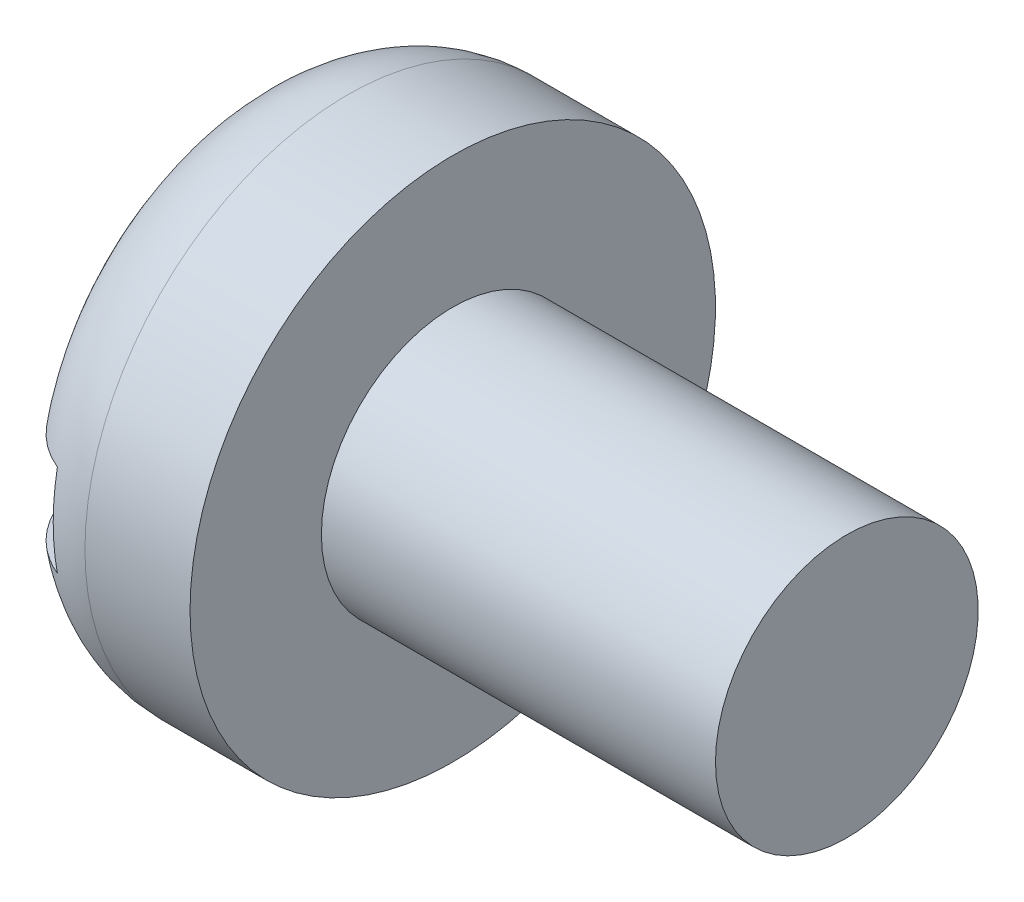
ISO-10303-21;
HEADER;
FILE_DESCRIPTION(('STEP AP214'),'2;1');
FILE_NAME('part.step','',(''),(''),'','','');
FILE_SCHEMA(('AUTOMOTIVE_DESIGN { 1 0 10303 214 1 1 1 1 }'));
ENDSEC;
DATA;
#1=APPLICATION_CONTEXT('core data for automotive mechanical design processes');
#2=APPLICATION_PROTOCOL_DEFINITION('international standard','automotive_design',2000,#1);
#3=PRODUCT_CONTEXT('',#1,'mechanical');
#4=PRODUCT('Part','Part','',(#3));
#5=PRODUCT_RELATED_PRODUCT_CATEGORY('part','',(#4));
#6=PRODUCT_DEFINITION_FORMATION('','',#4);
#7=PRODUCT_DEFINITION_CONTEXT('part definition',#1,'design');
#8=PRODUCT_DEFINITION('design','',#6,#7);
#9=PRODUCT_DEFINITION_SHAPE('','',#8);
#10=(LENGTH_UNIT() NAMED_UNIT(*) SI_UNIT(.MILLI.,.METRE.));
#11=(NAMED_UNIT(*) PLANE_ANGLE_UNIT() SI_UNIT($,.RADIAN.));
#12=(NAMED_UNIT(*) SI_UNIT($,.STERADIAN.) SOLID_ANGLE_UNIT());
#13=UNCERTAINTY_MEASURE_WITH_UNIT(LENGTH_MEASURE(1.E-05),#10,'distance_accuracy_value','');
#14=(GEOMETRIC_REPRESENTATION_CONTEXT(3) GLOBAL_UNCERTAINTY_ASSIGNED_CONTEXT((#13)) GLOBAL_UNIT_ASSIGNED_CONTEXT((#10,
#11,#12)) REPRESENTATION_CONTEXT('',''));
#15=CARTESIAN_POINT('',(0.,0.,0.));
#16=DIRECTION('',(0.,0.,1.));
#17=DIRECTION('',(1.,0.,0.));
#18=AXIS2_PLACEMENT_3D('',#15,#16,#17);
#19=CARTESIAN_POINT('',(0.,0.,0.));
#20=DIRECTION('',(-1.,0.,0.));
#21=DIRECTION('',(0.,0.,1.));
#22=AXIS2_PLACEMENT_3D('',#19,#20,#21);
#23=PLANE('',#22);
#24=DIRECTION('',(0.,0.,-1.));
#25=VECTOR('',#24,1.);
#26=CARTESIAN_POINT('',(0.,0.349999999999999,2.));
#27=LINE('',#26,#25);
#28=CARTESIAN_POINT('',(0.,0.349999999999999,1.1478240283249));
#29=VERTEX_POINT('',#28);
#30=CARTESIAN_POINT('',(0.,0.349999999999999,-1.1478240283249));
#31=VERTEX_POINT('',#30);
#32=EDGE_CURVE('E95',#29,#31,#27,.T.);
#33=ORIENTED_EDGE('',*,*,#32,.F.);
#34=CARTESIAN_POINT('',(0.,0.,0.));
#35=DIRECTION('',(-1.,0.,0.));
#36=DIRECTION('',(0.,0.,1.));
#37=AXIS2_PLACEMENT_3D('',#34,#35,#36);
#38=CIRCLE('',#37,1.2);
#39=EDGE_CURVE('E102',#29,#31,#38,.T.);
#40=ORIENTED_EDGE('',*,*,#39,.T.);
#41=EDGE_LOOP('',(#33,#40));
#42=FACE_BOUND('',#41,.T.);
#43=ADVANCED_FACE('F42',(#42),#23,.T.);
#44=CARTESIAN_POINT('',(-25.4,0.,0.));
#45=DIRECTION('',(-1.,0.,0.));
#46=DIRECTION('',(0.,0.,1.));
#47=AXIS2_PLACEMENT_3D('',#44,#45,#46);
#48=CYLINDRICAL_SURFACE('',#47,1.);
#49=CARTESIAN_POINT('',(4.6,0.,0.));
#50=DIRECTION('',(-1.,0.,0.));
#51=DIRECTION('',(0.,0.,1.));
#52=AXIS2_PLACEMENT_3D('',#49,#50,#51);
#53=CIRCLE('',#52,1.);
#54=CARTESIAN_POINT('',(4.6,0.,1.));
#55=VERTEX_POINT('',#54);
#56=EDGE_CURVE('E106',#55,#55,#53,.T.);
#57=ORIENTED_EDGE('',*,*,#56,.T.);
#58=EDGE_LOOP('',(#57));
#59=FACE_BOUND('',#58,.T.);
#60=CARTESIAN_POINT('',(1.6,0.,0.));
#61=DIRECTION('',(-1.,0.,0.));
#62=DIRECTION('',(0.,0.,1.));
#63=AXIS2_PLACEMENT_3D('',#60,#61,#62);
#64=CIRCLE('',#63,1.);
#65=CARTESIAN_POINT('',(1.6,0.,1.));
#66=VERTEX_POINT('',#65);
#67=EDGE_CURVE('E169',#66,#66,#64,.T.);
#68=ORIENTED_EDGE('',*,*,#67,.F.);
#69=EDGE_LOOP('',(#68));
#70=FACE_BOUND('',#69,.T.);
#71=ADVANCED_FACE('F44',(#59,#70),#48,.T.);
#72=CARTESIAN_POINT('',(4.6,1.,0.));
#73=DIRECTION('',(1.,0.,0.));
#74=DIRECTION('',(0.,0.,-1.));
#75=AXIS2_PLACEMENT_3D('',#72,#73,#74);
#76=PLANE('',#75);
#77=ORIENTED_EDGE('',*,*,#56,.F.);
#78=EDGE_LOOP('',(#77));
#79=FACE_BOUND('',#78,.T.);
#80=ADVANCED_FACE('F155',(#79),#76,.T.);
#81=DIRECTION('',(0.,0.,1.));
#82=VECTOR('',#81,1.);
#83=CARTESIAN_POINT('',(0.,-0.35,-2.));
#84=LINE('',#83,#82);
#85=CARTESIAN_POINT('',(0.,-0.35,-1.1478240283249));
#86=VERTEX_POINT('',#85);
#87=CARTESIAN_POINT('',(0.,-0.35,1.1478240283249));
#88=VERTEX_POINT('',#87);
#89=EDGE_CURVE('E86',#86,#88,#84,.T.);
#90=ORIENTED_EDGE('',*,*,#89,.F.);
#91=EDGE_CURVE('E93',#86,#88,#38,.T.);
#92=ORIENTED_EDGE('',*,*,#91,.T.);
#93=EDGE_LOOP('',(#90,#92));
#94=FACE_BOUND('',#93,.T.);
#95=ADVANCED_FACE('F92',(#94),#23,.T.);
#96=CARTESIAN_POINT('',(0.800000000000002,0.,0.));
#97=DIRECTION('',(-1.,0.,0.));
#98=DIRECTION('',(0.,0.,1.));
#99=AXIS2_PLACEMENT_3D('',#96,#97,#98);
#100=TOROIDAL_SURFACE('',#99,1.2,0.8);
#101=CARTESIAN_POINT('',(0.251886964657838,0.349999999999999,-1.74803308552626));
#102=CARTESIAN_POINT('',(0.284106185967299,0.349999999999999,-1.77894053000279));
#103=CARTESIAN_POINT('',(0.3189134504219,0.349999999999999,-1.80714880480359));
#104=CARTESIAN_POINT('',(0.392764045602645,0.349999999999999,-1.85733761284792));
#105=CARTESIAN_POINT('',(0.431807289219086,0.349999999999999,-1.87931827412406));
#106=CARTESIAN_POINT('',(0.513054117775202,0.349999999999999,-1.91639870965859));
#107=CARTESIAN_POINT('',(0.555258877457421,0.349999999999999,-1.93149591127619));
#108=CARTESIAN_POINT('',(0.641613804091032,0.349999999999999,-1.95434046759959));
#109=CARTESIAN_POINT('',(0.685763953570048,0.349999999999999,-1.96208788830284));
#110=CARTESIAN_POINT('',(0.774465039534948,0.349999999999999,-1.96997317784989));
#111=CARTESIAN_POINT('',(0.819011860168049,0.349999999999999,-1.97015740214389));
#112=CARTESIAN_POINT('',(0.907500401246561,0.349999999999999,-1.96302819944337));
#113=CARTESIAN_POINT('',(0.951442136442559,0.349999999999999,-1.95571495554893));
#114=CARTESIAN_POINT('',(1.03738817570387,0.349999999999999,-1.93383211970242));
#115=CARTESIAN_POINT('',(1.07939605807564,0.349999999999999,-1.9192765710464));
#116=CARTESIAN_POINT('',(1.16038685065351,0.349999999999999,-1.88334999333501));
#117=CARTESIAN_POINT('',(1.19936974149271,0.349999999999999,-1.8619789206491));
#118=CARTESIAN_POINT('',(1.27340405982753,0.349999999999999,-1.81294134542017));
#119=CARTESIAN_POINT('',(1.30843691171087,0.349999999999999,-1.78524681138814));
#120=CARTESIAN_POINT('',(1.3734217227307,0.349999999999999,-1.72443226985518));
#121=CARTESIAN_POINT('',(1.40337349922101,0.349999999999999,-1.6913120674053));
#122=CARTESIAN_POINT('',(1.45774858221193,0.349999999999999,-1.62017981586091));
#123=CARTESIAN_POINT('',(1.48210165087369,0.349999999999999,-1.58211410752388));
#124=CARTESIAN_POINT('',(1.52422592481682,0.349999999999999,-1.50250494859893));
#125=CARTESIAN_POINT('',(1.54199667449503,0.349999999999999,-1.46096125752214));
#126=CARTESIAN_POINT('',(1.57090761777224,0.349999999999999,-1.37460737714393));
#127=CARTESIAN_POINT('',(1.58189252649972,0.349999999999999,-1.32974527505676));
#128=CARTESIAN_POINT('',(1.59646688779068,0.349999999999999,-1.23884208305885));
#129=CARTESIAN_POINT('',(1.60005538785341,0.349999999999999,-1.19280084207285));
#130=CARTESIAN_POINT('',(1.5999412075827,0.349999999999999,-1.09898565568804));
#131=CARTESIAN_POINT('',(1.59595668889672,0.349999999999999,-1.05121225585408));
#132=CARTESIAN_POINT('',(1.58051554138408,0.349999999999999,-0.956902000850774));
#133=CARTESIAN_POINT('',(1.56905773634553,0.349999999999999,-0.910365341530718));
#134=CARTESIAN_POINT('',(1.53830789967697,0.349999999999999,-0.816640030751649));
#135=CARTESIAN_POINT('',(1.51855977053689,0.349999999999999,-0.769601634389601));
#136=CARTESIAN_POINT('',(1.47218777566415,0.349999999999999,-0.679051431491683));
#137=CARTESIAN_POINT('',(1.44556043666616,0.349999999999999,-0.635541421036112));
#138=CARTESIAN_POINT('',(1.38324599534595,0.349999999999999,-0.548261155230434));
#139=CARTESIAN_POINT('',(1.34689115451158,0.349999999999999,-0.504969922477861));
#140=CARTESIAN_POINT('',(1.26825683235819,0.349999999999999,-0.424127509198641));
#141=CARTESIAN_POINT('',(1.22597536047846,0.349999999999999,-0.386578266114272));
#142=CARTESIAN_POINT('',(1.1507280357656,0.349999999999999,-0.329106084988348));
#143=CARTESIAN_POINT('',(1.11911593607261,0.349999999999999,-0.30738962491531));
#144=CARTESIAN_POINT('',(1.05351876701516,0.349999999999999,-0.267765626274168));
#145=CARTESIAN_POINT('',(1.0195345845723,0.349999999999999,-0.249856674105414));
#146=CARTESIAN_POINT('',(0.960659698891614,0.349999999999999,-0.224864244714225));
#147=CARTESIAN_POINT('',(0.936473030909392,0.349999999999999,-0.216158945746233));
#148=CARTESIAN_POINT('',(0.887106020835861,0.349999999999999,-0.202605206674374));
#149=CARTESIAN_POINT('',(0.861931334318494,0.349999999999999,-0.197737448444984));
#150=CARTESIAN_POINT('',(0.810783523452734,0.349999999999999,-0.192964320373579));
#151=CARTESIAN_POINT('',(0.784804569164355,0.349999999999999,-0.193116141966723));
#152=CARTESIAN_POINT('',(0.733333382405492,0.349999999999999,-0.198492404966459));
#153=CARTESIAN_POINT('',(0.707843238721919,0.349999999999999,-0.203735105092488));
#154=CARTESIAN_POINT('',(0.64758083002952,0.349999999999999,-0.22098097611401));
#155=CARTESIAN_POINT('',(0.613385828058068,0.349999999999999,-0.234894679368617));
#156=CARTESIAN_POINT('',(0.547202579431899,0.349999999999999,-0.267318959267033));
#157=CARTESIAN_POINT('',(0.515224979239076,0.349999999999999,-0.28584998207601));
#158=CARTESIAN_POINT('',(0.457751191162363,0.349999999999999,-0.323360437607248));
#159=CARTESIAN_POINT('',(0.431974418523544,0.349999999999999,-0.341913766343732));
#160=CARTESIAN_POINT('',(0.382049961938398,0.349999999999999,-0.381103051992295));
#161=CARTESIAN_POINT('',(0.357903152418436,0.349999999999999,-0.401740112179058));
#162=CARTESIAN_POINT('',(0.288179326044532,0.349999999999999,-0.466439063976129));
#163=CARTESIAN_POINT('',(0.245194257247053,0.349999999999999,-0.513371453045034));
#164=CARTESIAN_POINT('',(0.16781108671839,0.349999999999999,-0.614139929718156));
#165=CARTESIAN_POINT('',(0.133444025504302,0.349999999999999,-0.66799994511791));
#166=CARTESIAN_POINT('',(0.0754909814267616,0.349999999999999,-0.781273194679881));
#167=CARTESIAN_POINT('',(0.0518963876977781,0.349999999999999,-0.840681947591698));
#168=CARTESIAN_POINT('',(0.0190222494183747,0.349999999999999,-0.956707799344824));
#169=CARTESIAN_POINT('',(0.00851196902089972,0.349999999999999,-1.01297553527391));
#170=CARTESIAN_POINT('',(-0.00156617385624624,0.349999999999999,-1.1264972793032));
#171=CARTESIAN_POINT('',(-0.00114050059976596,0.349999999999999,-1.18375068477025));
#172=CARTESIAN_POINT('',(0.0103252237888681,0.349999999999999,-1.29044131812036));
#173=CARTESIAN_POINT('',(0.0201263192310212,0.349999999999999,-1.34001381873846));
#174=CARTESIAN_POINT('',(0.0484733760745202,0.349999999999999,-1.43658734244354));
#175=CARTESIAN_POINT('',(0.0670141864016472,0.349999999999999,-1.48358986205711));
#176=CARTESIAN_POINT('',(0.110304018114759,0.349999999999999,-1.56930412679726));
#177=CARTESIAN_POINT('',(0.134333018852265,0.349999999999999,-1.60838106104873));
#178=CARTESIAN_POINT('',(0.188633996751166,0.349999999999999,-1.68192512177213));
#179=CARTESIAN_POINT('',(0.218904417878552,0.349999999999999,-1.71639339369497));
#180=CARTESIAN_POINT('',(0.251886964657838,0.349999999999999,-1.74803308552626));
#181=B_SPLINE_CURVE_WITH_KNOTS('',3,(#101,#102,#103,#104,#105,#106,#107,#108,#109,#110,#111,
#112,#113,#114,#115,#116,#117,#118,#119,#120,#121,#122,#123,#124,#125,#126,#127,#128,#129,#130,
#131,#132,#133,#134,#135,#136,#137,#138,#139,#140,#141,#142,#143,#144,#145,#146,#147,#148,#149,
#150,#151,#152,#153,#154,#155,#156,#157,#158,#159,#160,#161,#162,#163,#164,#165,#166,#167,#168,
#169,#170,#171,#172,#173,#174,#175,#176,#177,#178,#179,#180),.UNSPECIFIED.,.T.,.F.,(4,2,2,2,2,2,
2,2,2,2,2,2,2,2,2,2,2,2,2,2,2,2,2,2,2,2,2,2,2,2,2,2,2,2,2,2,2,2,2,4),(0.,0.133781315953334,
0.267559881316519,0.40138840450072,0.535215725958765,0.668222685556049,0.801226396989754,
0.933973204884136,1.06672086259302,1.20006881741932,1.33342156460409,1.4683656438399,
1.60331906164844,1.7412562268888,1.8792111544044,2.02240092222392,2.16561323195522,
2.31802799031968,2.4705198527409,2.63947463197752,2.80848629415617,2.92336541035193,
3.03820180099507,3.11510771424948,3.19162396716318,3.26901231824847,3.34667925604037,
3.45683323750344,3.56748394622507,3.66264122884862,3.75784916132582,3.94782137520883,
4.13846831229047,4.32896258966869,4.49970272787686,4.67034194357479,4.821155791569,
4.97188086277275,5.10886578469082,5.24581659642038),.UNSPECIFIED.);
#182=CARTESIAN_POINT('',(0.5,0.349999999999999,-1.90981350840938));
#183=VERTEX_POINT('',#182);
#184=EDGE_CURVE('E13',#31,#183,#181,.T.);
#185=ORIENTED_EDGE('',*,*,#184,.F.);
#186=ORIENTED_EDGE('',*,*,#39,.F.);
#187=CARTESIAN_POINT('',(0.350977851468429,0.349999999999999,0.40845344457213));
#188=CARTESIAN_POINT('',(0.372851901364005,0.349999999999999,0.388917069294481));
#189=CARTESIAN_POINT('',(0.395464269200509,0.349999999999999,0.370208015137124));
#190=CARTESIAN_POINT('',(0.442071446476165,0.349999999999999,0.334600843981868));
#191=CARTESIAN_POINT('',(0.466066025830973,0.349999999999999,0.317702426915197));
#192=CARTESIAN_POINT('',(0.515379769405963,0.349999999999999,0.286051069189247));
#193=CARTESIAN_POINT('',(0.540696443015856,0.349999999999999,0.27129427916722));
#194=CARTESIAN_POINT('',(0.59272627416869,0.349999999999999,0.244555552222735));
#195=CARTESIAN_POINT('',(0.619436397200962,0.349999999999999,0.232567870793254));
#196=CARTESIAN_POINT('',(0.671056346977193,0.349999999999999,0.213819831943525));
#197=CARTESIAN_POINT('',(0.695793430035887,0.349999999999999,0.206602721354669));
#198=CARTESIAN_POINT('',(0.746045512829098,0.349999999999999,0.196633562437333));
#199=CARTESIAN_POINT('',(0.771554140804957,0.349999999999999,0.193851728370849));
#200=CARTESIAN_POINT('',(0.822750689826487,0.349999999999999,0.193467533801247));
#201=CARTESIAN_POINT('',(0.84843884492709,0.349999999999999,0.195892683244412));
#202=CARTESIAN_POINT('',(0.89905755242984,0.349999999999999,0.20528952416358));
#203=CARTESIAN_POINT('',(0.923982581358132,0.349999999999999,0.212288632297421));
#204=CARTESIAN_POINT('',(0.987885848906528,0.349999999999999,0.234847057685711));
#205=CARTESIAN_POINT('',(1.02590578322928,0.349999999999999,0.253022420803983));
#206=CARTESIAN_POINT('',(1.09911347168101,0.349999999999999,0.294330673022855));
#207=CARTESIAN_POINT('',(1.13429275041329,0.349999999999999,0.31747769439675));
#208=CARTESIAN_POINT('',(1.21975887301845,0.349999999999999,0.380794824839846));
#209=CARTESIAN_POINT('',(1.26820018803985,0.349999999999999,0.423495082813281));
#210=CARTESIAN_POINT('',(1.35726570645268,0.349999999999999,0.516275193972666));
#211=CARTESIAN_POINT('',(1.39790020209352,0.349999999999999,0.566345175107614));
#212=CARTESIAN_POINT('',(1.46922610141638,0.349999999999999,0.672658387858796));
#213=CARTESIAN_POINT('',(1.4999901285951,0.349999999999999,0.728852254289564));
#214=CARTESIAN_POINT('',(1.54999742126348,0.349999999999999,0.846186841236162));
#215=CARTESIAN_POINT('',(1.56924794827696,0.349999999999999,0.907324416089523));
#216=CARTESIAN_POINT('',(1.59299302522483,0.349999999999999,1.02410639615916));
#217=CARTESIAN_POINT('',(1.59908512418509,0.349999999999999,1.07942675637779));
#218=CARTESIAN_POINT('',(1.6007218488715,0.349999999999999,1.19022623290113));
#219=CARTESIAN_POINT('',(1.59627399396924,0.349999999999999,1.24570520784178));
#220=CARTESIAN_POINT('',(1.57770680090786,0.349999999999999,1.34895835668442));
#221=CARTESIAN_POINT('',(1.56465952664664,0.349999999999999,1.39692705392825));
#222=CARTESIAN_POINT('',(1.53022815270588,0.349999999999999,1.48977349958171));
#223=CARTESIAN_POINT('',(1.50884736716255,0.349999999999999,1.53465246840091));
#224=CARTESIAN_POINT('',(1.45971253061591,0.349999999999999,1.61744214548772));
#225=CARTESIAN_POINT('',(1.43237537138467,0.349999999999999,1.65560073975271));
#226=CARTESIAN_POINT('',(1.37150367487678,0.349999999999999,1.72660667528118));
#227=CARTESIAN_POINT('',(1.33797027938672,0.349999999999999,1.75945499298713));
#228=CARTESIAN_POINT('',(1.26674657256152,0.349999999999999,1.81791134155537));
#229=CARTESIAN_POINT('',(1.22920771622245,0.349999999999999,1.84370406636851));
#230=CARTESIAN_POINT('',(1.15027758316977,0.349999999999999,1.8885025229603));
#231=CARTESIAN_POINT('',(1.10888669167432,0.349999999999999,1.90750893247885));
#232=CARTESIAN_POINT('',(1.02413562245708,0.349999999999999,1.93790256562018));
#233=CARTESIAN_POINT('',(0.980816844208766,0.349999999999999,1.94940532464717));
#234=CARTESIAN_POINT('',(0.892858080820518,0.349999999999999,1.96491723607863));
#235=CARTESIAN_POINT('',(0.848218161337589,0.349999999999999,1.96892676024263));
#236=CARTESIAN_POINT('',(0.759222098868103,0.349999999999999,1.9693294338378));
#237=CARTESIAN_POINT('',(0.714866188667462,0.349999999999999,1.96577639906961));
#238=CARTESIAN_POINT('',(0.627382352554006,0.349999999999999,1.95127037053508));
#239=CARTESIAN_POINT('',(0.584254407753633,0.349999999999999,1.94031749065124));
#240=CARTESIAN_POINT('',(0.500459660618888,0.349999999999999,1.91134458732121));
#241=CARTESIAN_POINT('',(0.459792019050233,0.349999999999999,1.89332698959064));
#242=CARTESIAN_POINT('',(0.382034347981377,0.349999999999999,1.85076012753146));
#243=CARTESIAN_POINT('',(0.344944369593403,0.349999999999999,1.8262107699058));
#244=CARTESIAN_POINT('',(0.275135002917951,0.349999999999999,1.77113062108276));
#245=CARTESIAN_POINT('',(0.242444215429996,0.349999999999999,1.74056359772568));
#246=CARTESIAN_POINT('',(0.182574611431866,0.349999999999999,1.67444307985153));
#247=CARTESIAN_POINT('',(0.155395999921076,0.349999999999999,1.63888939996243));
#248=CARTESIAN_POINT('',(0.10688859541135,0.349999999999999,1.56328438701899));
#249=CARTESIAN_POINT('',(0.0856476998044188,0.349999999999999,1.52317669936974));
#250=CARTESIAN_POINT('',(0.0500166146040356,0.349999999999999,1.44002927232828));
#251=CARTESIAN_POINT('',(0.0356272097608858,0.349999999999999,1.39698919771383));
#252=CARTESIAN_POINT('',(0.0136769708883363,0.349999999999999,1.30804309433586));
#253=CARTESIAN_POINT('',(0.00629905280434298,0.349999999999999,1.2620920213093));
#254=CARTESIAN_POINT('',(-0.000971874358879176,0.349999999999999,1.16961605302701));
#255=CARTESIAN_POINT('',(-0.000864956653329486,0.349999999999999,1.12309116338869));
#256=CARTESIAN_POINT('',(0.0067628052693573,0.349999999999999,1.02864456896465));
#257=CARTESIAN_POINT('',(0.0146024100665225,0.349999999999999,0.980748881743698));
#258=CARTESIAN_POINT('',(0.0376656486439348,0.349999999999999,0.886752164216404));
#259=CARTESIAN_POINT('',(0.0528951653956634,0.349999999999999,0.840652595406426));
#260=CARTESIAN_POINT('',(0.0914025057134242,0.349999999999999,0.747924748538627));
#261=CARTESIAN_POINT('',(0.115193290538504,0.349999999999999,0.701510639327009));
#262=CARTESIAN_POINT('',(0.169387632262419,0.349999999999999,0.612843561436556));
#263=CARTESIAN_POINT('',(0.199780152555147,0.349999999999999,0.570583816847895));
#264=CARTESIAN_POINT('',(0.251028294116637,0.349999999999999,0.508889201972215));
#265=CARTESIAN_POINT('',(0.269944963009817,0.349999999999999,0.487805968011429));
#266=CARTESIAN_POINT('',(0.309334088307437,0.349999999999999,0.447038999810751));
#267=CARTESIAN_POINT('',(0.329810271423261,0.349999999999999,0.427358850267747));
#268=CARTESIAN_POINT('',(0.350977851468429,0.349999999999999,0.40845344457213));
#269=B_SPLINE_CURVE_WITH_KNOTS('',3,(#187,#188,#189,#190,#191,#192,#193,#194,#195,#196,#197,
#198,#199,#200,#201,#202,#203,#204,#205,#206,#207,#208,#209,#210,#211,#212,#213,#214,#215,#216,
#217,#218,#219,#220,#221,#222,#223,#224,#225,#226,#227,#228,#229,#230,#231,#232,#233,#234,#235,
#236,#237,#238,#239,#240,#241,#242,#243,#244,#245,#246,#247,#248,#249,#250,#251,#252,#253,#254,
#255,#256,#257,#258,#259,#260,#261,#262,#263,#264,#265,#266,#267,#268),.UNSPECIFIED.,.T.,.F.,(4,
2,2,2,2,2,2,2,2,2,2,2,2,2,2,2,2,2,2,2,2,2,2,2,2,2,2,2,2,2,2,2,2,2,2,2,2,2,2,2,4),(0.,
0.0879625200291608,0.175910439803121,0.263698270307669,0.351302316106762,0.428315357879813,
0.504808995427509,0.581707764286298,0.659071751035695,0.784811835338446,0.910914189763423,
1.10368375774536,1.29619741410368,1.48726028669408,1.67820252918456,1.84423200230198,
2.01014306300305,2.15851584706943,2.30682968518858,2.44695762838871,2.58705977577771,
2.7230370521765,2.85900074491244,2.99281820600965,3.12662902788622,3.2594908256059,
3.39235057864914,3.52516475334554,3.65798082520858,3.79162248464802,3.92526911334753,
4.0608003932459,4.19634719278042,4.33534022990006,4.47433190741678,4.6193032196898,
4.76439013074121,4.92023309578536,5.0758175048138,5.16072939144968,5.24585097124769),.UNSPECIFIED.);
#270=CARTESIAN_POINT('',(0.5,0.349999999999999,1.90981350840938));
#271=VERTEX_POINT('',#270);
#272=EDGE_CURVE('E120',#271,#29,#269,.T.);
#273=ORIENTED_EDGE('',*,*,#272,.F.);
#274=CARTESIAN_POINT('',(0.5,0.,0.));
#275=DIRECTION('',(-1.,0.,0.));
#276=DIRECTION('',(0.,0.,1.));
#277=AXIS2_PLACEMENT_3D('',#274,#275,#276);
#278=CIRCLE('',#277,1.94161984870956);
#279=CARTESIAN_POINT('',(0.5,-0.35,1.90981350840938));
#280=VERTEX_POINT('',#279);
#281=EDGE_CURVE('E114',#271,#280,#278,.F.);
#282=ORIENTED_EDGE('',*,*,#281,.T.);
#283=CARTESIAN_POINT('',(0.350977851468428,-0.35,0.408453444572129));
#284=CARTESIAN_POINT('',(0.307541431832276,-0.35,0.447238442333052));
#285=CARTESIAN_POINT('',(0.266951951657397,-0.35,0.489339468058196));
#286=CARTESIAN_POINT('',(0.192746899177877,-0.35,0.57946347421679));
#287=CARTESIAN_POINT('',(0.159149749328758,-0.35,0.627501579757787));
#288=CARTESIAN_POINT('',(0.0984786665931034,-0.35,0.732232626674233));
#289=CARTESIAN_POINT('',(0.0720362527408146,-0.35,0.789297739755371));
#290=CARTESIAN_POINT('',(0.0308536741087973,-0.35,0.907480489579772));
#291=CARTESIAN_POINT('',(0.0160974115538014,-0.35,0.968592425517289));
#292=CARTESIAN_POINT('',(0.000673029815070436,-0.35,1.08415221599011));
#293=CARTESIAN_POINT('',(-0.00163082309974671,-0.35,1.13838325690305));
#294=CARTESIAN_POINT('',(0.00390802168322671,-0.35,1.24633559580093));
#295=CARTESIAN_POINT('',(0.0117457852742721,-0.35,1.30005712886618));
#296=CARTESIAN_POINT('',(0.0363342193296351,-0.35,1.39999782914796));
#297=CARTESIAN_POINT('',(0.0521659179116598,-0.35,1.44644449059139));
#298=CARTESIAN_POINT('',(0.0917995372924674,-0.35,1.53580144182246));
#299=CARTESIAN_POINT('',(0.11559836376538,-0.35,1.57871309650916));
#300=CARTESIAN_POINT('',(0.169158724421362,-0.35,1.65756914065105));
#301=CARTESIAN_POINT('',(0.198568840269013,-0.35,1.69375259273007));
#302=CARTESIAN_POINT('',(0.263196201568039,-0.35,1.76049876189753));
#303=CARTESIAN_POINT('',(0.298412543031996,-0.35,1.79106235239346));
#304=CARTESIAN_POINT('',(0.372627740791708,-0.35,1.84487082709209));
#305=CARTESIAN_POINT('',(0.411501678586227,-0.35,1.86828814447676));
#306=CARTESIAN_POINT('',(0.492671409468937,-0.35,1.90815622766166));
#307=CARTESIAN_POINT('',(0.53496689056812,-0.35,1.92460762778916));
#308=CARTESIAN_POINT('',(0.621137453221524,-0.35,1.949856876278));
#309=CARTESIAN_POINT('',(0.664982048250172,-0.35,1.95875886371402));
#310=CARTESIAN_POINT('',(0.753544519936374,-0.35,1.96902786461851));
#311=CARTESIAN_POINT('',(0.798262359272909,-0.35,1.97039519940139));
#312=CARTESIAN_POINT('',(0.887024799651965,-0.35,1.96556817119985));
#313=CARTESIAN_POINT('',(0.931071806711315,-0.35,1.95941789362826));
#314=CARTESIAN_POINT('',(1.01750849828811,-0.35,1.93981456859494));
#315=CARTESIAN_POINT('',(1.05989819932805,-0.35,1.92636159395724));
#316=CARTESIAN_POINT('',(1.1418598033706,-0.35,1.89254119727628));
#317=CARTESIAN_POINT('',(1.18142951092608,-0.35,1.87216845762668));
#318=CARTESIAN_POINT('',(1.256619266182,-0.35,1.82511532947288));
#319=CARTESIAN_POINT('',(1.2922392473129,-0.35,1.79843483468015));
#320=CARTESIAN_POINT('',(1.35881674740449,-0.35,1.73932767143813));
#321=CARTESIAN_POINT('',(1.38973759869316,-0.35,1.70685972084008));
#322=CARTESIAN_POINT('',(1.44578791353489,-0.35,1.63726339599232));
#323=CARTESIAN_POINT('',(1.47091704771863,-0.35,1.60013475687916));
#324=CARTESIAN_POINT('',(1.51511995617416,-0.35,1.52166058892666));
#325=CARTESIAN_POINT('',(1.53409196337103,-0.35,1.48025778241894));
#326=CARTESIAN_POINT('',(1.56502100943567,-0.35,1.39491698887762));
#327=CARTESIAN_POINT('',(1.57697764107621,-0.35,1.35097885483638));
#328=CARTESIAN_POINT('',(1.59393824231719,-0.35,1.26051769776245));
#329=CARTESIAN_POINT('',(1.59873942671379,-0.35,1.21395676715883));
#330=CARTESIAN_POINT('',(1.60082549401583,-0.35,1.12066995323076));
#331=CARTESIAN_POINT('',(1.59810837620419,-0.35,1.07394402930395));
#332=CARTESIAN_POINT('',(1.58516977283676,-0.35,0.979284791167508));
#333=CARTESIAN_POINT('',(1.57459758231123,-0.35,0.93139971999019));
#334=CARTESIAN_POINT('',(1.54616391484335,-0.35,0.837881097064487));
#335=CARTESIAN_POINT('',(1.52830360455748,-0.35,0.792247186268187));
#336=CARTESIAN_POINT('',(1.48439243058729,-0.35,0.70058251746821));
#337=CARTESIAN_POINT('',(1.45780122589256,-0.35,0.654811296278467));
#338=CARTESIAN_POINT('',(1.39811851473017,-0.35,0.56766570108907));
#339=CARTESIAN_POINT('',(1.36501585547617,-0.35,0.526299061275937));
#340=CARTESIAN_POINT('',(1.28872706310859,-0.35,0.443429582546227));
#341=CARTESIAN_POINT('',(1.24478872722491,-0.35,0.402613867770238));
#342=CARTESIAN_POINT('',(1.1746037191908,-0.35,0.346890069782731));
#343=CARTESIAN_POINT('',(1.15049139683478,-0.35,0.329229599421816));
#344=CARTESIAN_POINT('',(1.10086203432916,-0.35,0.296021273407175));
#345=CARTESIAN_POINT('',(1.07534626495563,-0.35,0.280471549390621));
#346=CARTESIAN_POINT('',(1.02463387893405,-0.35,0.253025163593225));
#347=CARTESIAN_POINT('',(0.999534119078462,-0.35,0.240951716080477));
#348=CARTESIAN_POINT('',(0.948022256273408,-0.35,0.220119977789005));
#349=CARTESIAN_POINT('',(0.921614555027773,-0.35,0.211351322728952));
#350=CARTESIAN_POINT('',(0.872247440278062,-0.35,0.199730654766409));
#351=CARTESIAN_POINT('',(0.849475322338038,-0.35,0.196120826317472));
#352=CARTESIAN_POINT('',(0.803668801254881,-0.35,0.19299780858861));
#353=CARTESIAN_POINT('',(0.780634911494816,-0.35,0.193477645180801));
#354=CARTESIAN_POINT('',(0.735133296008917,-0.35,0.198383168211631));
#355=CARTESIAN_POINT('',(0.712663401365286,-0.35,0.202790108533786));
#356=CARTESIAN_POINT('',(0.668504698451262,-0.35,0.214681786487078));
#357=CARTESIAN_POINT('',(0.646819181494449,-0.35,0.222178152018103));
#358=CARTESIAN_POINT('',(0.60386709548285,-0.35,0.239605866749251));
#359=CARTESIAN_POINT('',(0.582623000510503,-0.35,0.249591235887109));
#360=CARTESIAN_POINT('',(0.541042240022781,-0.35,0.271314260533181));
#361=CARTESIAN_POINT('',(0.520706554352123,-0.35,0.283053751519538));
#362=CARTESIAN_POINT('',(0.461028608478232,-0.35,0.320346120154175));
#363=CARTESIAN_POINT('',(0.422969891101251,-0.35,0.347993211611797));
#364=CARTESIAN_POINT('',(0.374625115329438,-0.35,0.387764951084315));
#365=CARTESIAN_POINT('',(0.362697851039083,-0.35,0.397988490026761));
#366=CARTESIAN_POINT('',(0.350977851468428,-0.35,0.408453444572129));
#367=B_SPLINE_CURVE_WITH_KNOTS('',3,(#283,#284,#285,#286,#287,#288,#289,#290,#291,#292,#293,
#294,#295,#296,#297,#298,#299,#300,#301,#302,#303,#304,#305,#306,#307,#308,#309,#310,#311,#312,
#313,#314,#315,#316,#317,#318,#319,#320,#321,#322,#323,#324,#325,#326,#327,#328,#329,#330,#331,
#332,#333,#334,#335,#336,#337,#338,#339,#340,#341,#342,#343,#344,#345,#346,#347,#348,#349,#350,
#351,#352,#353,#354,#355,#356,#357,#358,#359,#360,#361,#362,#363,#364,#365,#366),.UNSPECIFIED.,
.T.,.F.,(4,2,2,2,2,2,2,2,2,2,2,2,2,2,2,2,2,2,2,2,2,2,2,2,2,2,2,2,2,2,2,2,2,2,2,2,2,2,2,2,2,4),
(0.,0.174667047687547,0.349788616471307,0.537328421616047,0.724609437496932,0.886556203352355,
1.04842420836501,1.19489125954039,1.34130149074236,1.4805004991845,1.61967785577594,
1.7551682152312,1.89064623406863,2.02422353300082,2.15779513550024,2.29058718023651,
2.42337790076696,2.55627089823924,2.68916613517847,2.82305029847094,2.95694207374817,
3.09294580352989,3.22895742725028,3.36875482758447,3.50858943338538,3.65507347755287,
3.80153408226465,3.95969513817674,4.11812948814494,4.29724567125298,4.38683381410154,
4.47634213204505,4.55974759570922,4.64288926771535,4.71174303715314,4.78047941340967,
4.84888942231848,4.91755929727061,4.98787388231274,5.05826256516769,5.19889158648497,
5.24602018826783),.UNSPECIFIED.);
#368=EDGE_CURVE('E101',#88,#280,#367,.T.);
#369=ORIENTED_EDGE('',*,*,#368,.F.);
#370=ORIENTED_EDGE('',*,*,#91,.F.);
#371=CARTESIAN_POINT('',(0.251886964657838,-0.35,-1.74803308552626));
#372=CARTESIAN_POINT('',(0.218817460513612,-0.35,-1.71630723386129));
#373=CARTESIAN_POINT('',(0.18844278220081,-0.35,-1.68170659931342));
#374=CARTESIAN_POINT('',(0.133954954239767,-0.35,-1.6078280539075));
#375=CARTESIAN_POINT('',(0.109852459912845,-0.35,-1.56854234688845));
#376=CARTESIAN_POINT('',(0.0685858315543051,-0.35,-1.48656659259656));
#377=CARTESIAN_POINT('',(0.0514098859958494,-0.35,-1.44388249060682));
#378=CARTESIAN_POINT('',(0.0242998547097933,-0.35,-1.35630204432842));
#379=CARTESIAN_POINT('',(0.0143630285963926,-0.35,-1.31140654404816));
#380=CARTESIAN_POINT('',(0.00167493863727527,-0.35,-1.21955214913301));
#381=CARTESIAN_POINT('',(-0.000903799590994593,-0.35,-1.1725695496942));
#382=CARTESIAN_POINT('',(0.00146376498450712,-0.35,-1.07879045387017));
#383=CARTESIAN_POINT('',(0.00641332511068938,-0.35,-1.031994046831));
#384=CARTESIAN_POINT('',(0.0238943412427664,-0.35,-0.937344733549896));
#385=CARTESIAN_POINT('',(0.0368041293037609,-0.35,-0.88956206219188));
#386=CARTESIAN_POINT('',(0.0698187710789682,-0.35,-0.796607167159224));
#387=CARTESIAN_POINT('',(0.0899201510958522,-0.35,-0.751433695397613));
#388=CARTESIAN_POINT('',(0.138473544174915,-0.35,-0.660757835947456));
#389=CARTESIAN_POINT('',(0.167494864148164,-0.35,-0.615560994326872));
#390=CARTESIAN_POINT('',(0.231919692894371,-0.35,-0.529838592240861));
#391=CARTESIAN_POINT('',(0.267340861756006,-0.35,-0.489326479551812));
#392=CARTESIAN_POINT('',(0.34870090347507,-0.35,-0.408307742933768));
#393=CARTESIAN_POINT('',(0.395416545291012,-0.35,-0.368571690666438));
#394=CARTESIAN_POINT('',(0.469823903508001,-0.35,-0.315138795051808));
#395=CARTESIAN_POINT('',(0.495344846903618,-0.35,-0.298358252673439));
#396=CARTESIAN_POINT('',(0.547869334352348,-0.35,-0.267332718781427));
#397=CARTESIAN_POINT('',(0.574870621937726,-0.35,-0.253084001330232));
#398=CARTESIAN_POINT('',(0.626852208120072,-0.35,-0.229731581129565));
#399=CARTESIAN_POINT('',(0.651635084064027,-0.35,-0.220198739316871));
#400=CARTESIAN_POINT('',(0.702266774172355,-0.35,-0.20503751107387));
#401=CARTESIAN_POINT('',(0.72810778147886,-0.35,-0.199384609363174));
#402=CARTESIAN_POINT('',(0.78082525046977,-0.35,-0.193243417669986));
#403=CARTESIAN_POINT('',(0.807711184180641,-0.35,-0.192829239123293));
#404=CARTESIAN_POINT('',(0.861051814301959,-0.35,-0.197513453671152));
#405=CARTESIAN_POINT('',(0.887504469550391,-0.35,-0.202632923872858));
#406=CARTESIAN_POINT('',(0.948215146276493,-0.35,-0.219500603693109));
#407=CARTESIAN_POINT('',(0.981973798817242,-0.35,-0.232939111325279));
#408=CARTESIAN_POINT('',(1.04734672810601,-0.35,-0.264375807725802));
#409=CARTESIAN_POINT('',(1.07895058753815,-0.35,-0.282394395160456));
#410=CARTESIAN_POINT('',(1.13609184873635,-0.35,-0.31910289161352));
#411=CARTESIAN_POINT('',(1.16188366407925,-0.35,-0.337400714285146));
#412=CARTESIAN_POINT('',(1.2118596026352,-0.35,-0.376081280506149));
#413=CARTESIAN_POINT('',(1.2360428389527,-0.35,-0.396465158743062));
#414=CARTESIAN_POINT('',(1.30592077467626,-0.35,-0.460397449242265));
#415=CARTESIAN_POINT('',(1.34906667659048,-0.35,-0.506807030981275));
#416=CARTESIAN_POINT('',(1.42703676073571,-0.35,-0.606639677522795));
#417=CARTESIAN_POINT('',(1.46180850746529,-0.35,-0.660103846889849));
#418=CARTESIAN_POINT('',(1.52070243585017,-0.35,-0.772641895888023));
#419=CARTESIAN_POINT('',(1.54483310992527,-0.35,-0.831711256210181));
#420=CARTESIAN_POINT('',(1.57892864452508,-0.35,-0.947500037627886));
#421=CARTESIAN_POINT('',(1.5900564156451,-0.35,-1.00387614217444));
#422=CARTESIAN_POINT('',(1.60131974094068,-0.35,-1.11773046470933));
#423=CARTESIAN_POINT('',(1.60146190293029,-0.35,-1.17520799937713));
#424=CARTESIAN_POINT('',(1.59099642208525,-0.35,-1.2823411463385));
#425=CARTESIAN_POINT('',(1.58165028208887,-0.35,-1.33212209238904));
#426=CARTESIAN_POINT('',(1.55415800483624,-0.35,-1.42919018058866));
#427=CARTESIAN_POINT('',(1.5360162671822,-0.35,-1.47647855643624));
#428=CARTESIAN_POINT('',(1.49280341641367,-0.35,-1.56404183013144));
#429=CARTESIAN_POINT('',(1.46824757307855,-0.35,-1.60457163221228));
#430=CARTESIAN_POINT('',(1.41245707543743,-0.35,-1.68074150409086));
#431=CARTESIAN_POINT('',(1.381223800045,-0.35,-1.71638258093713));
#432=CARTESIAN_POINT('',(1.31413061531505,-0.35,-1.7805201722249));
#433=CARTESIAN_POINT('',(1.2784617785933,-0.35,-1.80921675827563));
#434=CARTESIAN_POINT('',(1.20273842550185,-0.35,-1.86008196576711));
#435=CARTESIAN_POINT('',(1.16268439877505,-0.35,-1.88225131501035));
#436=CARTESIAN_POINT('',(1.08011920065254,-0.35,-1.91903175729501));
#437=CARTESIAN_POINT('',(1.03766591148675,-0.35,-1.93377288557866));
#438=CARTESIAN_POINT('',(0.950877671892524,-0.35,-1.95584714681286));
#439=CARTESIAN_POINT('',(0.906542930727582,-0.35,-1.96318110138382));
#440=CARTESIAN_POINT('',(0.817670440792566,-0.35,-1.97018806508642));
#441=CARTESIAN_POINT('',(0.77313799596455,-0.35,-1.9699285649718));
#442=CARTESIAN_POINT('',(0.684736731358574,-0.35,-1.96192100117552));
#443=CARTESIAN_POINT('',(0.640868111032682,-0.35,-1.95417073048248));
#444=CARTESIAN_POINT('',(0.555111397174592,-0.35,-1.93142908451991));
#445=CARTESIAN_POINT('',(0.513221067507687,-0.35,-1.91644611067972));
#446=CARTESIAN_POINT('',(0.432581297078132,-0.35,-1.8796999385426));
#447=CARTESIAN_POINT('',(0.393827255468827,-0.35,-1.85794690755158));
#448=CARTESIAN_POINT('',(0.338462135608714,-0.35,-1.82048892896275));
#449=CARTESIAN_POINT('',(0.320293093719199,-0.35,-1.80703101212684));
#450=CARTESIAN_POINT('',(0.285159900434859,-0.35,-1.77862613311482));
#451=CARTESIAN_POINT('',(0.26819572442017,-0.35,-1.76367920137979));
#452=CARTESIAN_POINT('',(0.251886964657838,-0.35,-1.74803308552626));
#453=B_SPLINE_CURVE_WITH_KNOTS('',3,(#371,#372,#373,#374,#375,#376,#377,#378,#379,#380,#381,
#382,#383,#384,#385,#386,#387,#388,#389,#390,#391,#392,#393,#394,#395,#396,#397,#398,#399,#400,
#401,#402,#403,#404,#405,#406,#407,#408,#409,#410,#411,#412,#413,#414,#415,#416,#417,#418,#419,
#420,#421,#422,#423,#424,#425,#426,#427,#428,#429,#430,#431,#432,#433,#434,#435,#436,#437,#438,
#439,#440,#441,#442,#443,#444,#445,#446,#447,#448,#449,#450,#451,#452),.UNSPECIFIED.,.T.,.F.,(4,
2,2,2,2,2,2,2,2,2,2,2,2,2,2,2,2,2,2,2,2,2,2,2,2,2,2,2,2,2,2,2,2,2,2,2,2,2,2,2,4),(0.,
0.137395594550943,0.275023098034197,0.412414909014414,0.549754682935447,0.69028921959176,
0.830884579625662,0.978740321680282,1.12652474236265,1.28701325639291,1.44795158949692,
1.6310749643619,1.72261136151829,1.81401191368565,1.8934606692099,1.97240269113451,
2.05246026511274,2.13282384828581,2.24124549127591,2.35015875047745,2.44490717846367,
2.53970742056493,2.72887198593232,2.9191918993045,3.10935964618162,3.28076151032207,
3.45206027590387,3.60322562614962,3.75431544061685,3.89577666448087,4.03720870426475,
4.17388113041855,4.31053831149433,4.44471200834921,4.5788708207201,4.71183759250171,
4.84484355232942,4.97769538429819,5.11034865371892,5.17810889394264,5.2458677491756),.UNSPECIFIED.);
#454=CARTESIAN_POINT('',(0.5,-0.35,-1.90981350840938));
#455=VERTEX_POINT('',#454);
#456=EDGE_CURVE('E54',#455,#86,#453,.T.);
#457=ORIENTED_EDGE('',*,*,#456,.F.);
#458=EDGE_CURVE('E66',#455,#183,#278,.F.);
#459=ORIENTED_EDGE('',*,*,#458,.T.);
#460=EDGE_LOOP('',(#185,#186,#273,#282,#369,#370,#457,#459));
#461=FACE_BOUND('',#460,.T.);
#462=CARTESIAN_POINT('',(0.800000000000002,0.,0.));
#463=DIRECTION('',(-1.,0.,0.));
#464=DIRECTION('',(0.,0.,1.));
#465=AXIS2_PLACEMENT_3D('',#462,#463,#464);
#466=CIRCLE('',#465,2.);
#467=CARTESIAN_POINT('',(0.800000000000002,0.,2.));
#468=VERTEX_POINT('',#467);
#469=EDGE_CURVE('E103',#468,#468,#466,.T.);
#470=ORIENTED_EDGE('',*,*,#469,.T.);
#471=EDGE_LOOP('',(#470));
#472=FACE_BOUND('',#471,.T.);
#473=ADVANCED_FACE('F98',(#461,#472),#100,.T.);
#474=CARTESIAN_POINT('',(-25.4,0.,0.));
#475=DIRECTION('',(-1.,0.,0.));
#476=DIRECTION('',(0.,0.,1.));
#477=AXIS2_PLACEMENT_3D('',#474,#475,#476);
#478=CYLINDRICAL_SURFACE('',#477,2.);
#479=CARTESIAN_POINT('',(1.6,0.,0.));
#480=DIRECTION('',(-1.,0.,0.));
#481=DIRECTION('',(0.,0.,1.));
#482=AXIS2_PLACEMENT_3D('',#479,#480,#481);
#483=CIRCLE('',#482,2.);
#484=CARTESIAN_POINT('',(1.6,0.,2.));
#485=VERTEX_POINT('',#484);
#486=EDGE_CURVE('E108',#485,#485,#483,.T.);
#487=ORIENTED_EDGE('',*,*,#486,.T.);
#488=EDGE_LOOP('',(#487));
#489=FACE_BOUND('',#488,.T.);
#490=ORIENTED_EDGE('',*,*,#469,.F.);
#491=EDGE_LOOP('',(#490));
#492=FACE_BOUND('',#491,.T.);
#493=ADVANCED_FACE('F141',(#489,#492),#478,.T.);
#494=CARTESIAN_POINT('',(1.6,1.,0.));
#495=DIRECTION('',(-1.,0.,0.));
#496=DIRECTION('',(0.,0.,1.));
#497=AXIS2_PLACEMENT_3D('',#494,#495,#496);
#498=PLANE('',#497);
#499=ORIENTED_EDGE('',*,*,#486,.F.);
#500=EDGE_LOOP('',(#499));
#501=FACE_BOUND('',#500,.T.);
#502=ORIENTED_EDGE('',*,*,#67,.T.);
#503=EDGE_LOOP('',(#502));
#504=FACE_BOUND('',#503,.T.);
#505=ADVANCED_FACE('F137',(#501,#504),#498,.F.);
#506=CARTESIAN_POINT('',(0.5,0.349999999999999,2.));
#507=DIRECTION('',(0.,1.,0.));
#508=DIRECTION('',(0.,0.,1.));
#509=AXIS2_PLACEMENT_3D('',#506,#507,#508);
#510=PLANE('',#509);
#511=ORIENTED_EDGE('',*,*,#184,.T.);
#512=DIRECTION('',(0.,0.,-1.));
#513=VECTOR('',#512,1.);
#514=CARTESIAN_POINT('',(0.5,0.349999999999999,2.));
#515=LINE('',#514,#513);
#516=EDGE_CURVE('E94',#271,#183,#515,.T.);
#517=ORIENTED_EDGE('',*,*,#516,.F.);
#518=ORIENTED_EDGE('',*,*,#272,.T.);
#519=ORIENTED_EDGE('',*,*,#32,.T.);
#520=EDGE_LOOP('',(#511,#517,#518,#519));
#521=FACE_BOUND('',#520,.T.);
#522=ADVANCED_FACE('F130',(#521),#510,.F.);
#523=CARTESIAN_POINT('',(0.5,-0.35,-2.));
#524=DIRECTION('',(0.,-1.,0.));
#525=DIRECTION('',(0.,0.,-1.));
#526=AXIS2_PLACEMENT_3D('',#523,#524,#525);
#527=PLANE('',#526);
#528=ORIENTED_EDGE('',*,*,#456,.T.);
#529=ORIENTED_EDGE('',*,*,#89,.T.);
#530=ORIENTED_EDGE('',*,*,#368,.T.);
#531=DIRECTION('',(0.,0.,1.));
#532=VECTOR('',#531,1.);
#533=CARTESIAN_POINT('',(0.5,-0.35,-2.));
#534=LINE('',#533,#532);
#535=EDGE_CURVE('E61',#455,#280,#534,.T.);
#536=ORIENTED_EDGE('',*,*,#535,.F.);
#537=EDGE_LOOP('',(#528,#529,#530,#536));
#538=FACE_BOUND('',#537,.T.);
#539=ADVANCED_FACE('F85',(#538),#527,.F.);
#540=CARTESIAN_POINT('',(0.5,0.349999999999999,-2.));
#541=DIRECTION('',(-1.,0.,0.));
#542=DIRECTION('',(0.,0.,1.));
#543=AXIS2_PLACEMENT_3D('',#540,#541,#542);
#544=PLANE('',#543);
#545=ORIENTED_EDGE('',*,*,#535,.T.);
#546=ORIENTED_EDGE('',*,*,#281,.F.);
#547=ORIENTED_EDGE('',*,*,#516,.T.);
#548=ORIENTED_EDGE('',*,*,#458,.F.);
#549=EDGE_LOOP('',(#545,#546,#547,#548));
#550=FACE_BOUND('',#549,.T.);
#551=ADVANCED_FACE('F129',(#550),#544,.T.);
#552=CLOSED_SHELL('',(#43,#71,#80,#95,#473,#493,#505,#522,#539,#551));
#553=MANIFOLD_SOLID_BREP('B2',#552);
#554=ADVANCED_BREP_SHAPE_REPRESENTATION('',(#18,#553),#14);
#555=SHAPE_DEFINITION_REPRESENTATION(#9,#554);
ENDSEC;
END-ISO-10303-21;
